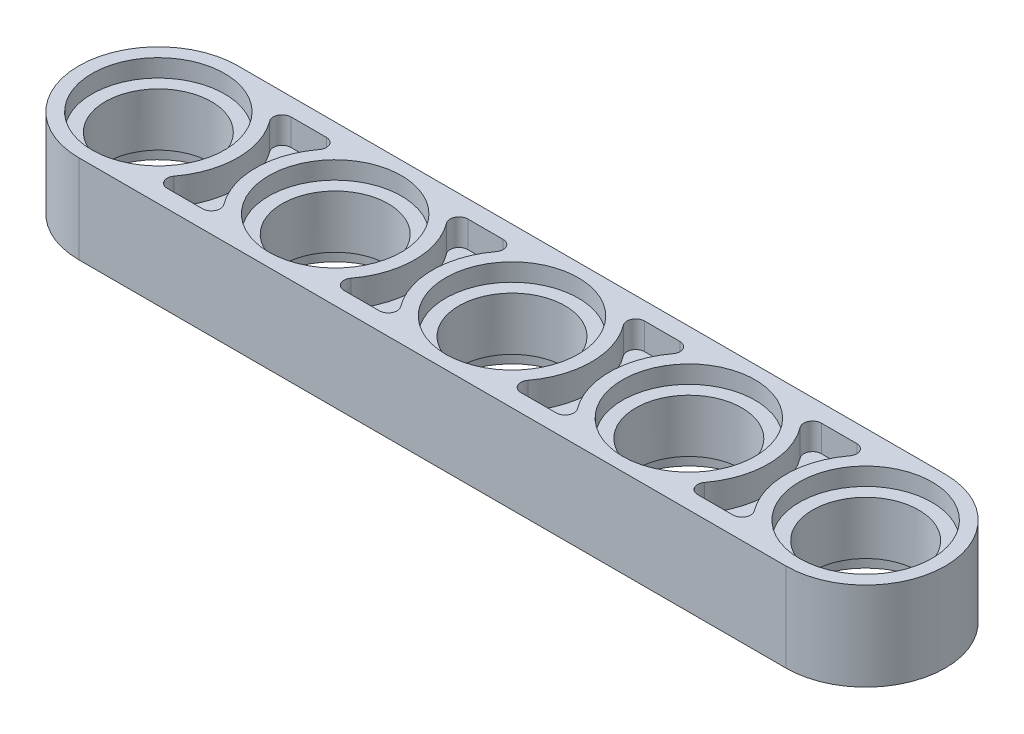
from build123d import *

# Parameters (mm, degrees)
BOSS_EXTRUDE1_DEPTH      = 2
BOSS_EXTRUDE1_DEPTH_BACK = 2
SKETCH2_R                = 2.4
CUT_EXTRUDE1_DEPTH       = 21.325353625
SKETCH3_R                = 3
CUT_EXTRUDE2_DEPTH       = 0.8
CUT_EXTRUDE4_START       = -1.2
CUT_EXTRUDE4_DEPTH       = 1.2


with BuildPart() as part:
    # Sketch1 → Boss-Extrude1 (new, two sides: drawn at the far end of the back side and taken through both)
    with BuildSketch(Plane(origin=(0, 0, 0), x_dir=(1, 0, 0), z_dir=(0, 1, 0)).offset(-BOSS_EXTRUDE1_DEPTH_BACK)):
        with BuildLine():
            Line((-16, 3.6), (16, 3.6))
            ThreePointArc((16, 3.6), (19.6, 0), (16, -3.6))
            Line((16, -3.6), (-16, -3.6))
            ThreePointArc((-16, -3.6), (-19.6, 0), (-16, 3.6))
        make_face()
    extrude(amount=BOSS_EXTRUDE1_DEPTH + BOSS_EXTRUDE1_DEPTH_BACK)

    # Sketch2 → Cut-Extrude1 (cut, through all)
    with BuildSketch(Plane(origin=(0, 2, 0), x_dir=(1, 0, 0), z_dir=(0, 1, 0))):
        with Locations(Location((-16, 0, 0), (0, 0, 270))):
            Circle(SKETCH2_R)
        with Locations(Location((-8, 0, 0), (0, 0, 270))):
            Circle(SKETCH2_R)
        with Locations(Location((0, 0, 0), (0, 0, 270))):
            Circle(SKETCH2_R)
        with Locations(Location((8, 0, 0), (0, 0, 270))):
            Circle(SKETCH2_R)
        with Locations(Location((16, 0, 0), (0, 0, 270))):
            Circle(SKETCH2_R)
    extrude(amount=-CUT_EXTRUDE1_DEPTH, mode=Mode.SUBTRACT)

    # Sketch3 → Cut-Extrude2 (cut)
    with BuildSketch(Plane(origin=(0, 2, 0), x_dir=(1, 0, 0), z_dir=(0, 1, 0))):
        with Locations(Location((-16, 0, 0), (0, 0, 270))):
            Circle(SKETCH3_R)
        with Locations(Location((-8, 0, 0), (0, 0, 270))):
            Circle(SKETCH3_R)
        with Locations(Location((0, 0, 0), (0, 0, 270))):
            Circle(SKETCH3_R)
        with Locations(Location((8, 0, 0), (0, 0, 270))):
            Circle(SKETCH3_R)
        with Locations(Location((16, 0, 0), (0, 0, 270))):
            Circle(SKETCH3_R)
    cut_extrude2 = extrude(amount=-CUT_EXTRUDE2_DEPTH, mode=Mode.SUBTRACT)

    # Sketch4 → Cut-Extrude4 (cut)
    with BuildSketch(Plane(origin=(0, 2, 0), x_dir=(1, 0, 0), z_dir=(0, 1, 0)).offset(CUT_EXTRUDE4_START)):
        with BuildLine():
            Line((-12.8, 2.8), (-11.2, 2.8))
            ThreePointArc((-11.2, 2.8), (-10.842229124, 2.578885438), (-10.88, 2.16))
            ThreePointArc((-10.88, 2.16), (-11.6, 0), (-10.88, -2.16))
            ThreePointArc((-10.88, -2.16), (-10.842229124, -2.578885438), (-11.2, -2.8))
            Line((-11.2, -2.8), (-12.8, -2.8))
            ThreePointArc((-12.8, -2.8), (-13.157770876, -2.578885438), (-13.12, -2.16))
            ThreePointArc((-13.12, -2.16), (-12.4, 0), (-13.12, 2.16))
            ThreePointArc((-13.12, 2.16), (-13.157770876, 2.578885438), (-12.8, 2.8))
        make_face()
        with BuildLine():
            Line((-4.8, 2.8), (-3.2, 2.8))
            ThreePointArc((-3.2, 2.8), (-2.842229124, 2.578885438), (-2.88, 2.16))
            ThreePointArc((-2.88, 2.16), (-3.6, 0), (-2.88, -2.16))
            ThreePointArc((-2.88, -2.16), (-2.842229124, -2.578885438), (-3.2, -2.8))
            Line((-3.2, -2.8), (-4.8, -2.8))
            ThreePointArc((-4.8, -2.8), (-5.157770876, -2.578885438), (-5.12, -2.16))
            ThreePointArc((-5.12, -2.16), (-4.4, 0), (-5.12, 2.16))
            ThreePointArc((-5.12, 2.16), (-5.157770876, 2.578885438), (-4.8, 2.8))
        make_face()
        with BuildLine():
            Line((3.2, 2.8), (4.8, 2.8))
            ThreePointArc((4.8, 2.8), (5.157770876, 2.578885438), (5.12, 2.16))
            ThreePointArc((5.12, 2.16), (4.4, 0), (5.12, -2.16))
            ThreePointArc((5.12, -2.16), (5.157770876, -2.578885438), (4.8, -2.8))
            Line((4.8, -2.8), (3.2, -2.8))
            ThreePointArc((3.2, -2.8), (2.842229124, -2.578885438), (2.88, -2.16))
            ThreePointArc((2.88, -2.16), (3.6, 0), (2.88, 2.16))
            ThreePointArc((2.88, 2.16), (2.842229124, 2.578885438), (3.2, 2.8))
        make_face()
        with BuildLine():
            Line((11.2, 2.8), (12.8, 2.8))
            ThreePointArc((12.8, 2.8), (13.157770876, 2.578885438), (13.12, 2.16))
            ThreePointArc((13.12, 2.16), (12.4, 0), (13.12, -2.16))
            ThreePointArc((13.12, -2.16), (13.157770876, -2.578885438), (12.8, -2.8))
            Line((12.8, -2.8), (11.2, -2.8))
            ThreePointArc((11.2, -2.8), (10.842229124, -2.578885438), (10.88, -2.16))
            ThreePointArc((10.88, -2.16), (11.6, 0), (10.88, 2.16))
            ThreePointArc((10.88, 2.16), (10.842229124, 2.578885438), (11.2, 2.8))
        make_face()
    cut_extrude4 = extrude(amount=CUT_EXTRUDE4_DEPTH, mode=Mode.SUBTRACT)

    # Mirror1: Cut-Extrude2, Cut-Extrude4 across plane
    add(cut_extrude2.mirror(Plane.ZX), mode=Mode.SUBTRACT)
    add(cut_extrude4.mirror(Plane.ZX), mode=Mode.SUBTRACT)


solid = part.part
